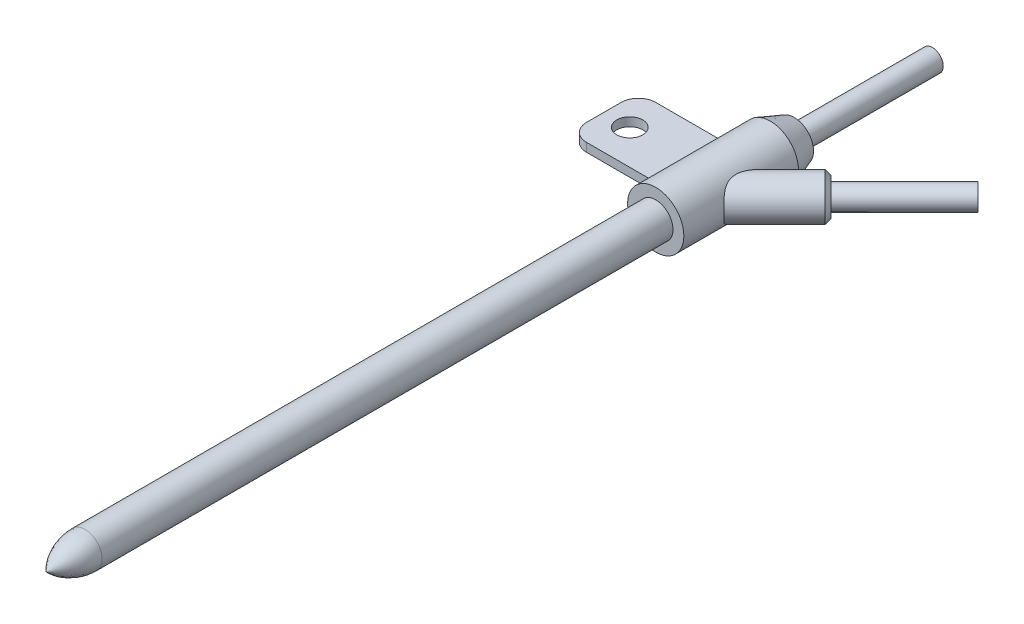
ISO-10303-21;
HEADER;
FILE_DESCRIPTION(('STEP AP214'),'2;1');
FILE_NAME('part.step','',(''),(''),'','','');
FILE_SCHEMA(('AUTOMOTIVE_DESIGN { 1 0 10303 214 1 1 1 1 }'));
ENDSEC;
DATA;
#1=APPLICATION_CONTEXT('core data for automotive mechanical design processes');
#2=APPLICATION_PROTOCOL_DEFINITION('international standard','automotive_design',2000,#1);
#3=PRODUCT_CONTEXT('',#1,'mechanical');
#4=PRODUCT('Part','Part','',(#3));
#5=PRODUCT_RELATED_PRODUCT_CATEGORY('part','',(#4));
#6=PRODUCT_DEFINITION_FORMATION('','',#4);
#7=PRODUCT_DEFINITION_CONTEXT('part definition',#1,'design');
#8=PRODUCT_DEFINITION('design','',#6,#7);
#9=PRODUCT_DEFINITION_SHAPE('','',#8);
#10=(LENGTH_UNIT() NAMED_UNIT(*) SI_UNIT(.MILLI.,.METRE.));
#11=(NAMED_UNIT(*) PLANE_ANGLE_UNIT() SI_UNIT($,.RADIAN.));
#12=(NAMED_UNIT(*) SI_UNIT($,.STERADIAN.) SOLID_ANGLE_UNIT());
#13=UNCERTAINTY_MEASURE_WITH_UNIT(LENGTH_MEASURE(1.E-05),#10,'distance_accuracy_value','');
#14=(GEOMETRIC_REPRESENTATION_CONTEXT(3) GLOBAL_UNCERTAINTY_ASSIGNED_CONTEXT((#13)) GLOBAL_UNIT_ASSIGNED_CONTEXT((#10,
#11,#12)) REPRESENTATION_CONTEXT('',''));
#15=CARTESIAN_POINT('',(0.,0.,0.));
#16=DIRECTION('',(0.,0.,1.));
#17=DIRECTION('',(1.,0.,0.));
#18=AXIS2_PLACEMENT_3D('',#15,#16,#17);
#19=CARTESIAN_POINT('',(0.,0.,-90.));
#20=DIRECTION('',(0.,0.,1.));
#21=DIRECTION('',(1.,0.,0.));
#22=AXIS2_PLACEMENT_3D('',#19,#20,#21);
#23=CYLINDRICAL_SURFACE('',#22,1.25);
#24=CARTESIAN_POINT('',(0.,0.,-82.));
#25=DIRECTION('',(0.,0.,1.));
#26=DIRECTION('',(1.,0.,0.));
#27=AXIS2_PLACEMENT_3D('',#24,#25,#26);
#28=CIRCLE('',#27,1.25);
#29=CARTESIAN_POINT('',(1.25,0.,-82.));
#30=VERTEX_POINT('',#29);
#31=CARTESIAN_POINT('',(-1.25,0.,-82.));
#32=VERTEX_POINT('',#31);
#33=EDGE_CURVE('E222',#30,#32,#28,.T.);
#34=ORIENTED_EDGE('',*,*,#33,.F.);
#35=CARTESIAN_POINT('',(0.,0.,-82.));
#36=DIRECTION('',(0.,0.,1.));
#37=DIRECTION('',(1.,0.,0.));
#38=AXIS2_PLACEMENT_3D('',#35,#36,#37);
#39=CIRCLE('',#38,1.25);
#40=EDGE_CURVE('E238',#32,#30,#39,.T.);
#41=ORIENTED_EDGE('',*,*,#40,.F.);
#42=DIRECTION('',(0.,0.,-1.));
#43=VECTOR('',#42,1.);
#44=CARTESIAN_POINT('',(-1.25,0.,-90.));
#45=LINE('',#44,#43);
#46=CARTESIAN_POINT('',(-1.25,0.,-98.));
#47=VERTEX_POINT('',#46);
#48=EDGE_CURVE('E10',#32,#47,#45,.T.);
#49=ORIENTED_EDGE('',*,*,#48,.T.);
#50=CARTESIAN_POINT('',(0.,0.,-98.));
#51=DIRECTION('',(0.,0.,1.));
#52=DIRECTION('',(1.,0.,0.));
#53=AXIS2_PLACEMENT_3D('',#50,#51,#52);
#54=CIRCLE('',#53,1.25);
#55=CARTESIAN_POINT('',(1.25,0.,-98.));
#56=VERTEX_POINT('',#55);
#57=EDGE_CURVE('E29',#47,#56,#54,.T.);
#58=ORIENTED_EDGE('',*,*,#57,.T.);
#59=CARTESIAN_POINT('',(0.,0.,-98.));
#60=DIRECTION('',(0.,0.,1.));
#61=DIRECTION('',(1.,0.,0.));
#62=AXIS2_PLACEMENT_3D('',#59,#60,#61);
#63=CIRCLE('',#62,1.25);
#64=EDGE_CURVE('E212',#56,#47,#63,.T.);
#65=ORIENTED_EDGE('',*,*,#64,.T.);
#66=ORIENTED_EDGE('',*,*,#48,.F.);
#67=EDGE_LOOP('',(#34,#41,#49,#58,#65,#66));
#68=FACE_BOUND('',#67,.T.);
#69=ADVANCED_FACE('F15',(#68),#23,.T.);
#70=CARTESIAN_POINT('',(1.25,0.,-98.));
#71=DIRECTION('',(0.,0.,-1.));
#72=DIRECTION('',(-1.,0.,0.));
#73=AXIS2_PLACEMENT_3D('',#70,#71,#72);
#74=PLANE('',#73);
#75=ORIENTED_EDGE('',*,*,#64,.F.);
#76=ORIENTED_EDGE('',*,*,#57,.F.);
#77=EDGE_LOOP('',(#75,#76));
#78=FACE_BOUND('',#77,.T.);
#79=ADVANCED_FACE('F335',(#78),#74,.T.);
#80=CARTESIAN_POINT('',(-2.,0.,0.));
#81=CARTESIAN_POINT('',(-2.,-2.,0.));
#82=CARTESIAN_POINT('',(0.,-2.,0.));
#83=CARTESIAN_POINT('',(2.,-2.,0.));
#84=CARTESIAN_POINT('',(2.,0.,0.));
#85=CARTESIAN_POINT('',(2.,2.,0.));
#86=CARTESIAN_POINT('',(0.,2.,0.));
#87=CARTESIAN_POINT('',(-2.,2.,0.));
#88=CARTESIAN_POINT('',(-2.,0.,0.));
#89=CARTESIAN_POINT('',(-2.,0.,2.69444444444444));
#90=CARTESIAN_POINT('',(-2.,-2.,2.69444444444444));
#91=CARTESIAN_POINT('',(0.,-2.,2.69444444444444));
#92=CARTESIAN_POINT('',(2.,-2.,2.69444444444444));
#93=CARTESIAN_POINT('',(2.,0.,2.69444444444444));
#94=CARTESIAN_POINT('',(2.,2.,2.69444444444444));
#95=CARTESIAN_POINT('',(0.,2.,2.69444444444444));
#96=CARTESIAN_POINT('',(-2.,2.,2.69444444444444));
#97=CARTESIAN_POINT('',(-2.,0.,2.69444444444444));
#98=CARTESIAN_POINT('',(0.,0.,4.5));
#99=CARTESIAN_POINT('',(0.,0.,4.5));
#100=CARTESIAN_POINT('',(0.,0.,4.5));
#101=CARTESIAN_POINT('',(0.,0.,4.5));
#102=CARTESIAN_POINT('',(0.,0.,4.5));
#103=CARTESIAN_POINT('',(0.,0.,4.5));
#104=CARTESIAN_POINT('',(0.,0.,4.5));
#105=CARTESIAN_POINT('',(0.,0.,4.5));
#106=CARTESIAN_POINT('',(0.,0.,4.5));
#107=(BOUNDED_SURFACE() B_SPLINE_SURFACE(2,2,((#80,#81,#82,#83,#84,#85,#86,#87,#88),(#89,#90,
#91,#92,#93,#94,#95,#96,#97),(#98,#99,#100,#101,#102,#103,#104,#105,#106)),.UNSPECIFIED.,.F.,
.T.,.F.) B_SPLINE_SURFACE_WITH_KNOTS((3,3),(3,2,2,2,3),(0.,0.836448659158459),
(-3.14159265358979,-1.5707963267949,0.,1.5707963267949,3.14159265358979),
.UNSPECIFIED.) GEOMETRIC_REPRESENTATION_ITEM() RATIONAL_B_SPLINE_SURFACE(((1.,0.707106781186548,
1.,0.707106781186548,1.,0.707106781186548,1.,0.707106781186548,1.),(0.913811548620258,
0.646162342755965,0.913811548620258,0.646162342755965,0.913811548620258,0.646162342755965,
0.913811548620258,0.646162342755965,0.913811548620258),(1.,0.707106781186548,1.,
0.707106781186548,1.,0.707106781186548,1.,0.707106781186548,1.))) REPRESENTATION_ITEM('') SURFACE());
#108=CARTESIAN_POINT('',(4.0625,0.,0.));
#109=DIRECTION('',(0.,-1.,0.));
#110=DIRECTION('',(-1.,0.,0.));
#111=AXIS2_PLACEMENT_3D('',#108,#109,#110);
#112=CIRCLE('',#111,6.0625);
#113=CARTESIAN_POINT('',(0.,0.,4.5));
#114=VERTEX_POINT('',#113);
#115=CARTESIAN_POINT('',(-2.,0.,0.));
#116=VERTEX_POINT('',#115);
#117=EDGE_CURVE('E419',#114,#116,#112,.T.);
#118=CARTESIAN_POINT('',(0.,0.,0.));
#119=DIRECTION('',(0.,0.,1.));
#120=DIRECTION('',(1.,0.,0.));
#121=AXIS2_PLACEMENT_3D('',#118,#119,#120);
#122=CIRCLE('',#121,2.);
#123=CARTESIAN_POINT('',(2.,0.,0.));
#124=VERTEX_POINT('',#123);
#125=EDGE_CURVE('E234',#116,#124,#122,.T.);
#126=CARTESIAN_POINT('',(0.,0.,0.));
#127=DIRECTION('',(0.,0.,1.));
#128=DIRECTION('',(1.,0.,0.));
#129=AXIS2_PLACEMENT_3D('',#126,#127,#128);
#130=CIRCLE('',#129,2.);
#131=EDGE_CURVE('E162',#124,#116,#130,.T.);
#132=ORIENTED_EDGE('',*,*,#117,.T.);
#133=ORIENTED_EDGE('',*,*,#125,.T.);
#134=ORIENTED_EDGE('',*,*,#131,.T.);
#135=ORIENTED_EDGE('',*,*,#117,.F.);
#136=EDGE_LOOP('',(#132,#133,#134,#135));
#137=FACE_BOUND('',#136,.T.);
#138=ADVANCED_FACE('F339',(#137),#107,.F.);
#139=CARTESIAN_POINT('',(0.,0.,-33.));
#140=DIRECTION('',(0.,0.,1.));
#141=DIRECTION('',(1.,0.,0.));
#142=AXIS2_PLACEMENT_3D('',#139,#140,#141);
#143=CYLINDRICAL_SURFACE('',#142,2.);
#144=ORIENTED_EDGE('',*,*,#131,.F.);
#145=ORIENTED_EDGE('',*,*,#125,.F.);
#146=DIRECTION('',(0.,0.,-1.));
#147=VECTOR('',#146,1.);
#148=CARTESIAN_POINT('',(-2.,0.,-33.));
#149=LINE('',#148,#147);
#150=CARTESIAN_POINT('',(-2.,0.,-66.));
#151=VERTEX_POINT('',#150);
#152=EDGE_CURVE('E159',#116,#151,#149,.T.);
#153=ORIENTED_EDGE('',*,*,#152,.T.);
#154=CARTESIAN_POINT('',(0.,0.,-66.));
#155=DIRECTION('',(0.,0.,1.));
#156=DIRECTION('',(1.,0.,0.));
#157=AXIS2_PLACEMENT_3D('',#154,#155,#156);
#158=CIRCLE('',#157,2.);
#159=CARTESIAN_POINT('',(2.,0.,-66.));
#160=VERTEX_POINT('',#159);
#161=EDGE_CURVE('E152',#151,#160,#158,.T.);
#162=ORIENTED_EDGE('',*,*,#161,.T.);
#163=CARTESIAN_POINT('',(0.,0.,-66.));
#164=DIRECTION('',(0.,0.,1.));
#165=DIRECTION('',(1.,0.,0.));
#166=AXIS2_PLACEMENT_3D('',#163,#164,#165);
#167=CIRCLE('',#166,2.);
#168=EDGE_CURVE('E157',#160,#151,#167,.T.);
#169=ORIENTED_EDGE('',*,*,#168,.T.);
#170=ORIENTED_EDGE('',*,*,#152,.F.);
#171=EDGE_LOOP('',(#144,#145,#153,#162,#169,#170));
#172=FACE_BOUND('',#171,.T.);
#173=ADVANCED_FACE('F155',(#172),#143,.T.);
#174=CARTESIAN_POINT('',(2.,0.,-66.));
#175=DIRECTION('',(0.,0.,1.));
#176=DIRECTION('',(1.,0.,0.));
#177=AXIS2_PLACEMENT_3D('',#174,#175,#176);
#178=PLANE('',#177);
#179=ORIENTED_EDGE('',*,*,#168,.F.);
#180=ORIENTED_EDGE('',*,*,#161,.F.);
#181=EDGE_LOOP('',(#179,#180));
#182=FACE_BOUND('',#181,.T.);
#183=CARTESIAN_POINT('',(0.,0.,-66.));
#184=DIRECTION('',(0.,0.,1.));
#185=DIRECTION('',(1.,0.,0.));
#186=AXIS2_PLACEMENT_3D('',#183,#184,#185);
#187=CIRCLE('',#186,3.25);
#188=CARTESIAN_POINT('',(3.25,0.,-66.));
#189=VERTEX_POINT('',#188);
#190=CARTESIAN_POINT('',(-3.25,0.,-66.));
#191=VERTEX_POINT('',#190);
#192=EDGE_CURVE('E296',#189,#191,#187,.T.);
#193=ORIENTED_EDGE('',*,*,#192,.T.);
#194=CARTESIAN_POINT('',(0.,0.,-66.));
#195=DIRECTION('',(0.,0.,1.));
#196=DIRECTION('',(1.,0.,0.));
#197=AXIS2_PLACEMENT_3D('',#194,#195,#196);
#198=CIRCLE('',#197,3.25);
#199=EDGE_CURVE('E292',#191,#189,#198,.T.);
#200=ORIENTED_EDGE('',*,*,#199,.T.);
#201=EDGE_LOOP('',(#193,#200));
#202=FACE_BOUND('',#201,.T.);
#203=ADVANCED_FACE('F164',(#182,#202),#178,.T.);
#204=CARTESIAN_POINT('',(0.,0.,-74.));
#205=DIRECTION('',(0.,0.,1.));
#206=DIRECTION('',(1.,0.,0.));
#207=AXIS2_PLACEMENT_3D('',#204,#205,#206);
#208=CYLINDRICAL_SURFACE('',#207,3.25);
#209=CARTESIAN_POINT('',(2.34520787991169,2.25000000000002,-72.8977445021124));
#210=CARTESIAN_POINT('',(2.34521570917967,2.24998859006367,-72.9500101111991));
#211=CARTESIAN_POINT('',(2.34604445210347,2.24912802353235,-73.0022682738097));
#212=CARTESIAN_POINT('',(2.3492613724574,2.24576946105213,-73.1079119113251));
#213=CARTESIAN_POINT('',(2.35168563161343,2.24323357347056,-73.1612951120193));
#214=CARTESIAN_POINT('',(2.35807803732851,2.23651263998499,-73.2691870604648));
#215=CARTESIAN_POINT('',(2.36208274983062,2.23228850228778,-73.3236911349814));
#216=CARTESIAN_POINT('',(2.37160847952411,2.22216627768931,-73.4338282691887));
#217=CARTESIAN_POINT('',(2.37716572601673,2.216228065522,-73.4894544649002));
#218=CARTESIAN_POINT('',(2.38975906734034,2.20264374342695,-73.6018377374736));
#219=CARTESIAN_POINT('',(2.3968303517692,2.19495665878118,-73.6585858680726));
#220=CARTESIAN_POINT('',(2.4124033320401,2.17783094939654,-73.7732151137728));
#221=CARTESIAN_POINT('',(2.42093852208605,2.16835060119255,-73.8310853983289));
#222=CARTESIAN_POINT('',(2.43937949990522,2.1475860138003,-73.9479608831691));
#223=CARTESIAN_POINT('',(2.44931650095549,2.13625937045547,-74.0069535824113));
#224=CARTESIAN_POINT('',(2.47048945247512,2.11174128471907,-74.1260751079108));
#225=CARTESIAN_POINT('',(2.48175381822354,2.09850678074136,-74.1861899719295));
#226=CARTESIAN_POINT('',(2.50549650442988,2.07010623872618,-74.3075588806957));
#227=CARTESIAN_POINT('',(2.5179999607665,2.05489654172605,-74.3687977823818));
#228=CARTESIAN_POINT('',(2.5441249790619,2.0224667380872,-74.4924095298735));
#229=CARTESIAN_POINT('',(2.55776805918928,2.00520222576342,-74.5547660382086));
#230=CARTESIAN_POINT('',(2.59837263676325,1.95265801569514,-74.7354685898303));
#231=CARTESIAN_POINT('',(2.62613980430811,1.91530017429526,-74.8530465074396));
#232=CARTESIAN_POINT('',(2.66875101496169,1.8549515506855,-75.0255469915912));
#233=CARTESIAN_POINT('',(2.68288165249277,1.83447652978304,-75.0815365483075));
#234=CARTESIAN_POINT('',(2.71124340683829,1.79228718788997,-75.1916655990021));
#235=CARTESIAN_POINT('',(2.72546682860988,1.77060594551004,-75.2458196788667));
#236=CARTESIAN_POINT('',(2.75394073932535,1.7259770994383,-75.3522751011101));
#237=CARTESIAN_POINT('',(2.76818522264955,1.70306268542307,-75.404591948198));
#238=CARTESIAN_POINT('',(2.79662411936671,1.65593973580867,-75.5073725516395));
#239=CARTESIAN_POINT('',(2.81081429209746,1.63176427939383,-75.5578526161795));
#240=CARTESIAN_POINT('',(2.8390629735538,1.58209433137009,-75.6569585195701));
#241=CARTESIAN_POINT('',(2.85311906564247,1.55663249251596,-75.7056013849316));
#242=CARTESIAN_POINT('',(2.88101315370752,1.50436864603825,-75.8010330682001));
#243=CARTESIAN_POINT('',(2.89485058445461,1.4775985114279,-75.847839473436));
#244=CARTESIAN_POINT('',(2.92221824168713,1.42269639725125,-75.9395946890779));
#245=CARTESIAN_POINT('',(2.93574969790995,1.39459521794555,-75.9845615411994));
#246=CARTESIAN_POINT('',(2.96240573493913,1.3370275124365,-76.072648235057));
#247=CARTESIAN_POINT('',(2.97553336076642,1.30759010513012,-76.1157861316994));
#248=CARTESIAN_POINT('',(2.99756216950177,1.25604592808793,-76.1879314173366));
#249=CARTESIAN_POINT('',(3.00653876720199,1.23442049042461,-76.2172600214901));
#250=CARTESIAN_POINT('',(3.0240405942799,1.19088633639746,-76.2742414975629));
#251=CARTESIAN_POINT('',(3.03257095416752,1.16901038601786,-76.3019177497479));
#252=CARTESIAN_POINT('',(3.04916831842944,1.12499223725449,-76.3555992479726));
#253=CARTESIAN_POINT('',(3.05724131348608,1.1028828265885,-76.3816294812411));
#254=CARTESIAN_POINT('',(3.07291675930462,1.05840443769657,-76.4320154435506));
#255=CARTESIAN_POINT('',(3.08052593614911,1.03606838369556,-76.4563980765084));
#256=CARTESIAN_POINT('',(3.09526550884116,0.99114661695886,-76.5034873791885));
#257=CARTESIAN_POINT('',(3.1024034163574,0.968593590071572,-76.5262228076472));
#258=CARTESIAN_POINT('',(3.11619268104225,0.923247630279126,-76.5700157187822));
#259=CARTESIAN_POINT('',(3.1228523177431,0.900486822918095,-76.5911037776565));
#260=CARTESIAN_POINT('',(3.13567739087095,0.854735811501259,-76.6316001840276));
#261=CARTESIAN_POINT('',(3.14185184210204,0.831776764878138,-76.6510407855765));
#262=CARTESIAN_POINT('',(3.15369913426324,0.785640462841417,-76.6882406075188));
#263=CARTESIAN_POINT('',(3.15938165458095,0.762492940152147,-76.7060335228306));
#264=CARTESIAN_POINT('',(3.17023798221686,0.715991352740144,-76.7399366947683));
#265=CARTESIAN_POINT('',(3.17542201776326,0.692665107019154,-76.7560817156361));
#266=CARTESIAN_POINT('',(3.18527447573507,0.645819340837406,-76.7866878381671));
#267=CARTESIAN_POINT('',(3.18995351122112,0.622325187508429,-76.8011842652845));
#268=CARTESIAN_POINT('',(3.19878992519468,0.575154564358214,-76.8284939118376));
#269=CARTESIAN_POINT('',(3.20295806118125,0.551500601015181,-76.8413422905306));
#270=CARTESIAN_POINT('',(3.20885028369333,0.515676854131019,-76.8594626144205));
#271=CARTESIAN_POINT('',(3.21073750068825,0.503796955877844,-76.8652591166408));
#272=CARTESIAN_POINT('',(3.21438070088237,0.479999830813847,-76.8764359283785));
#273=CARTESIAN_POINT('',(3.21613798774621,0.468084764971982,-76.8818203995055));
#274=CARTESIAN_POINT('',(3.2195205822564,0.444219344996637,-76.8921730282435));
#275=CARTESIAN_POINT('',(3.22114715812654,0.432270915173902,-76.897145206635));
#276=CARTESIAN_POINT('',(3.22426770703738,0.408340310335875,-76.9066734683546));
#277=CARTESIAN_POINT('',(3.22576289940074,0.396359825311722,-76.9112333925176));
#278=CARTESIAN_POINT('',(3.2286200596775,0.37236680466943,-76.9199373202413));
#279=CARTESIAN_POINT('',(3.22998318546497,0.36035572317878,-76.9240849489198));
#280=CARTESIAN_POINT('',(3.23257562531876,0.336303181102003,-76.9319645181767));
#281=CARTESIAN_POINT('',(3.23380602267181,0.32426294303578,-76.9356998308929));
#282=CARTESIAN_POINT('',(3.23613244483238,0.300153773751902,-76.9427550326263));
#283=CARTESIAN_POINT('',(3.2372294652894,0.288085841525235,-76.9460780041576));
#284=CARTESIAN_POINT('',(3.23928860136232,0.263922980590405,-76.9523088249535));
#285=CARTESIAN_POINT('',(3.24025161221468,0.251828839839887,-76.9552194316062));
#286=CARTESIAN_POINT('',(3.24204222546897,0.22761522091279,-76.960625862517));
#287=CARTESIAN_POINT('',(3.24287061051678,0.215496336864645,-76.9631240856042));
#288=CARTESIAN_POINT('',(3.2443914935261,0.191235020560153,-76.9677061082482));
#289=CARTESIAN_POINT('',(3.24508465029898,0.179093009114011,-76.9697919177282));
#290=CARTESIAN_POINT('',(3.24642218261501,0.153084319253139,-76.9738127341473));
#291=CARTESIAN_POINT('',(3.24704713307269,0.139207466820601,-76.9756887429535));
#292=CARTESIAN_POINT('',(3.24811891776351,0.111427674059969,-76.9789023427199));
#293=CARTESIAN_POINT('',(3.24856628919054,0.0975249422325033,-76.9802415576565));
#294=CARTESIAN_POINT('',(3.24928237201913,0.0696957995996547,-76.9823826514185));
#295=CARTESIAN_POINT('',(3.2495513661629,0.0557694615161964,-76.9831853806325));
#296=CARTESIAN_POINT('',(3.24991016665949,0.0278952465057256,-76.9842531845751));
#297=CARTESIAN_POINT('',(3.24999999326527,0.0139473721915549,-76.9845183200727));
#298=CARTESIAN_POINT('',(3.25000000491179,-0.010172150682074,-76.9845161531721));
#299=CARTESIAN_POINT('',(3.24995223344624,-0.0203440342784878,-76.9843735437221));
#300=CARTESIAN_POINT('',(3.24976135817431,-0.0406742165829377,-76.9838074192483));
#301=CARTESIAN_POINT('',(3.24961830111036,-0.0508325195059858,-76.9833840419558));
#302=CARTESIAN_POINT('',(3.24923729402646,-0.0711344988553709,-76.9822557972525));
#303=CARTESIAN_POINT('',(3.24899931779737,-0.0812781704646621,-76.981550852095));
#304=CARTESIAN_POINT('',(3.24842893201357,-0.101549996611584,-76.9798599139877));
#305=CARTESIAN_POINT('',(3.24809642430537,-0.111678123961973,-76.978873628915));
#306=CARTESIAN_POINT('',(3.24727518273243,-0.133577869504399,-76.9764353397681));
#307=CARTESIAN_POINT('',(3.2467696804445,-0.145343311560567,-76.9749332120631));
#308=CARTESIAN_POINT('',(3.24563219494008,-0.168850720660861,-76.9715490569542));
#309=CARTESIAN_POINT('',(3.24499982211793,-0.180592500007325,-76.9696658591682));
#310=CARTESIAN_POINT('',(3.24360935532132,-0.204051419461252,-76.965519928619));
#311=CARTESIAN_POINT('',(3.24285075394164,-0.215768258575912,-76.9632556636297));
#312=CARTESIAN_POINT('',(3.24120859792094,-0.239176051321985,-76.9583479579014));
#313=CARTESIAN_POINT('',(3.24032442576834,-0.250866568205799,-76.9557026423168));
#314=CARTESIAN_POINT('',(3.23843190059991,-0.274220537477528,-76.9500331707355));
#315=CARTESIAN_POINT('',(3.2374228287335,-0.285883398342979,-76.9470068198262));
#316=CARTESIAN_POINT('',(3.23528128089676,-0.309180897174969,-76.9405755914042));
#317=CARTESIAN_POINT('',(3.23414799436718,-0.320814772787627,-76.9371682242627));
#318=CARTESIAN_POINT('',(3.23175879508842,-0.344053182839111,-76.9299752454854));
#319=CARTESIAN_POINT('',(3.23050199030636,-0.355656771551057,-76.9261868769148));
#320=CARTESIAN_POINT('',(3.2278665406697,-0.378833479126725,-76.9182321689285));
#321=CARTESIAN_POINT('',(3.2264869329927,-0.390405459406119,-76.914062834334));
#322=CARTESIAN_POINT('',(3.22360664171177,-0.413517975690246,-76.9053463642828));
#323=CARTESIAN_POINT('',(3.22210493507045,-0.425057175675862,-76.9007960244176));
#324=CARTESIAN_POINT('',(3.21898130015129,-0.448102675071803,-76.8913179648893));
#325=CARTESIAN_POINT('',(3.21735830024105,-0.459607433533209,-76.8863868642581));
#326=CARTESIAN_POINT('',(3.21228139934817,-0.494266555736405,-76.8709402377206));
#327=CARTESIAN_POINT('',(3.20866853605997,-0.517174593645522,-76.8599193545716));
#328=CARTESIAN_POINT('',(3.20097585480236,-0.562852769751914,-76.8363840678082));
#329=CARTESIAN_POINT('',(3.19688677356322,-0.58560581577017,-76.8238397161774));
#330=CARTESIAN_POINT('',(3.18824787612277,-0.630969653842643,-76.7972580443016));
#331=CARTESIAN_POINT('',(3.18368869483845,-0.653560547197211,-76.783189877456));
#332=CARTESIAN_POINT('',(3.17411607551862,-0.698592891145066,-76.7535614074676));
#333=CARTESIAN_POINT('',(3.16909341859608,-0.721011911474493,-76.7379700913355));
#334=CARTESIAN_POINT('',(3.15860016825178,-0.765693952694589,-76.705295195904));
#335=CARTESIAN_POINT('',(3.15312068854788,-0.787932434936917,-76.6881810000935));
#336=CARTESIAN_POINT('',(3.14172012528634,-0.832246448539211,-76.6524597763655));
#337=CARTESIAN_POINT('',(3.13579063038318,-0.854295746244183,-76.633822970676));
#338=CARTESIAN_POINT('',(3.12349638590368,-0.898224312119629,-76.5950555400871));
#339=CARTESIAN_POINT('',(3.11712379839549,-0.920076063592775,-76.5748962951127));
#340=CARTESIAN_POINT('',(3.10394977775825,-0.963602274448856,-76.5330827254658));
#341=CARTESIAN_POINT('',(3.09714114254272,-0.985248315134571,-76.5114011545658));
#342=CARTESIAN_POINT('',(3.08310152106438,-1.02835570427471,-76.4665414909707));
#343=CARTESIAN_POINT('',(3.07586400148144,-1.04978807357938,-76.4433376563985));
#344=CARTESIAN_POINT('',(3.06097320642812,-1.09246065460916,-76.3954319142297));
#345=CARTESIAN_POINT('',(3.0533140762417,-1.11367162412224,-76.3707058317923));
#346=CARTESIAN_POINT('',(3.03758679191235,-1.15589378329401,-76.3197540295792));
#347=CARTESIAN_POINT('',(3.02951345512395,-1.17687571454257,-76.293505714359));
#348=CARTESIAN_POINT('',(3.01296454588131,-1.21863261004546,-76.2395077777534));
#349=CARTESIAN_POINT('',(3.00448444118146,-1.23937852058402,-76.2117371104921));
#350=CARTESIAN_POINT('',(2.98712919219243,-1.28065452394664,-76.1546932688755));
#351=CARTESIAN_POINT('',(2.97825014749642,-1.30115587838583,-76.1254005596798));
#352=CARTESIAN_POINT('',(2.95059616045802,-1.36330771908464,-76.0338284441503));
#353=CARTESIAN_POINT('',(2.93164735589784,-1.40349520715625,-75.9706033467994));
#354=CARTESIAN_POINT('',(2.89884650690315,-1.46974174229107,-75.8602989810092));
#355=CARTESIAN_POINT('',(2.88505797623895,-1.49659841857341,-75.8136732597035));
#356=CARTESIAN_POINT('',(2.85732658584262,-1.54889327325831,-75.7190513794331));
#357=CARTESIAN_POINT('',(2.84338351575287,-1.57431535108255,-75.6710463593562));
#358=CARTESIAN_POINT('',(2.81543628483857,-1.62377134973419,-75.5736712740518));
#359=CARTESIAN_POINT('',(2.80143301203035,-1.647787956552,-75.5242921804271));
#360=CARTESIAN_POINT('',(2.77345264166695,-1.69446428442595,-75.4241678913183));
#361=CARTESIAN_POINT('',(2.75947761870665,-1.71710565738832,-75.3734135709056));
#362=CARTESIAN_POINT('',(2.73163611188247,-1.76106485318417,-75.2705386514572));
#363=CARTESIAN_POINT('',(2.7177729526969,-1.7823634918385,-75.2184089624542));
#364=CARTESIAN_POINT('',(2.69023067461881,-1.82367267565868,-75.1127854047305));
#365=CARTESIAN_POINT('',(2.67655613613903,-1.84366340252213,-75.0592826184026));
#366=CARTESIAN_POINT('',(2.63564616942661,-1.90214901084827,-74.8956069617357));
#367=CARTESIAN_POINT('',(2.60910672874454,-1.93825239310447,-74.7843985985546));
#368=CARTESIAN_POINT('',(2.55751197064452,-2.00586379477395,-74.5565750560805));
#369=CARTESIAN_POINT('',(2.53252226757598,-2.03720762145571,-74.4398966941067));
#370=CARTESIAN_POINT('',(2.49698624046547,-2.08036282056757,-74.2626216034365));
#371=CARTESIAN_POINT('',(2.48539013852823,-2.09418885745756,-74.2027183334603));
#372=CARTESIAN_POINT('',(2.46347134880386,-2.11992671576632,-74.0839415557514));
#373=CARTESIAN_POINT('',(2.45312346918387,-2.13187882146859,-74.0250815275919));
#374=CARTESIAN_POINT('',(2.43375402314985,-2.15396165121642,-73.908407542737));
#375=CARTESIAN_POINT('',(2.42470525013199,-2.16413122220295,-73.8506054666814));
#376=CARTESIAN_POINT('',(2.40800747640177,-2.18269380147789,-73.7360442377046));
#377=CARTESIAN_POINT('',(2.40032886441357,-2.19112523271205,-73.6792956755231));
#378=CARTESIAN_POINT('',(2.38641978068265,-2.20626461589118,-73.5668457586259));
#379=CARTESIAN_POINT('',(2.38015811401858,-2.21301012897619,-73.5111533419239));
#380=CARTESIAN_POINT('',(2.36879226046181,-2.22517310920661,-73.3973104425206));
#381=CARTESIAN_POINT('',(2.36374191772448,-2.23052944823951,-73.339147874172));
#382=CARTESIAN_POINT('',(2.35647448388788,-2.23820190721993,-73.2383068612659));
#383=CARTESIAN_POINT('',(2.35386057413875,-2.24094842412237,-73.1956893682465));
#384=CARTESIAN_POINT('',(2.34965428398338,-2.24535829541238,-73.1113090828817));
#385=CARTESIAN_POINT('',(2.34804026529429,-2.24704460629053,-73.0695486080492));
#386=CARTESIAN_POINT('',(2.34598539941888,-2.24918971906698,-72.9913404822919));
#387=CARTESIAN_POINT('',(2.34542044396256,-2.24977841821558,-72.9548997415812));
#388=CARTESIAN_POINT('',(2.3451579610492,-2.25005204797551,-72.882788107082));
#389=CARTESIAN_POINT('',(2.34544218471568,-2.24975599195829,-72.8471173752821));
#390=CARTESIAN_POINT('',(2.34686976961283,-2.24826674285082,-72.7765470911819));
#391=CARTESIAN_POINT('',(2.34799529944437,-2.24709216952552,-72.7416467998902));
#392=CARTESIAN_POINT('',(2.3511058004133,-2.24383745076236,-72.6726183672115));
#393=CARTESIAN_POINT('',(2.35307334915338,-2.2417756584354,-72.6384885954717));
#394=CARTESIAN_POINT('',(2.35767909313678,-2.2369307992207,-72.5734014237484));
#395=CARTESIAN_POINT('',(2.36024178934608,-2.23422849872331,-72.5424326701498));
#396=CARTESIAN_POINT('',(2.36607036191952,-2.22805493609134,-72.481180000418));
#397=CARTESIAN_POINT('',(2.36932339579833,-2.2245976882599,-72.4508934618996));
#398=CARTESIAN_POINT('',(2.37652468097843,-2.2169027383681,-72.3910063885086));
#399=CARTESIAN_POINT('',(2.38046085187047,-2.21267854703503,-72.3614026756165));
#400=CARTESIAN_POINT('',(2.38901473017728,-2.20343996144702,-72.3028816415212));
#401=CARTESIAN_POINT('',(2.39362132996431,-2.19843836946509,-72.2739606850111));
#402=CARTESIAN_POINT('',(2.40350082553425,-2.18763265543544,-72.2168056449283));
#403=CARTESIAN_POINT('',(2.40876371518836,-2.18184048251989,-72.1885675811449));
#404=CARTESIAN_POINT('',(2.41993784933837,-2.16943992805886,-72.1327786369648));
#405=CARTESIAN_POINT('',(2.42584031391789,-2.16284247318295,-72.1052235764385));
#406=CARTESIAN_POINT('',(2.43827319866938,-2.14881611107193,-72.0508008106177));
#407=CARTESIAN_POINT('',(2.44479615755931,-2.14139694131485,-72.0239288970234));
#408=CARTESIAN_POINT('',(2.45844705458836,-2.12571051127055,-71.9708724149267));
#409=CARTESIAN_POINT('',(2.46556890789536,-2.1174516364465,-71.9446838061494));
#410=CARTESIAN_POINT('',(2.48039201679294,-2.10006784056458,-71.8929937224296));
#411=CARTESIAN_POINT('',(2.4880885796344,-2.09094980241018,-71.8674885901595));
#412=CARTESIAN_POINT('',(2.50403288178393,-2.0718285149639,-71.8171650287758));
#413=CARTESIAN_POINT('',(2.51227728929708,-2.06183051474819,-71.7923435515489));
#414=CARTESIAN_POINT('',(2.52928636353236,-2.04092903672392,-71.7433866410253));
#415=CARTESIAN_POINT('',(2.53804897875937,-2.03002906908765,-71.7192489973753));
#416=CARTESIAN_POINT('',(2.55606081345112,-2.00730240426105,-71.6716588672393));
#417=CARTESIAN_POINT('',(2.56530913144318,-1.99547740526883,-71.6482052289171));
#418=CARTESIAN_POINT('',(2.58425592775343,-1.97087856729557,-71.6019820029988));
#419=CARTESIAN_POINT('',(2.59395447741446,-1.95810457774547,-71.5792125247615));
#420=CARTESIAN_POINT('',(2.61376245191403,-1.93158491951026,-71.5343563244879));
#421=CARTESIAN_POINT('',(2.62387270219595,-1.91783725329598,-71.5122711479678));
#422=CARTESIAN_POINT('',(2.64446187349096,-1.88934685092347,-71.4687820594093));
#423=CARTESIAN_POINT('',(2.65494212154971,-1.87460031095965,-71.4473812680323));
#424=CARTESIAN_POINT('',(2.67622614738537,-1.84408828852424,-71.4052594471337));
#425=CARTESIAN_POINT('',(2.68703147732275,-1.82831727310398,-71.3845432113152));
#426=CARTESIAN_POINT('',(2.70891730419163,-1.79573250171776,-71.3437884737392));
#427=CARTESIAN_POINT('',(2.719999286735,-1.77891159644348,-71.3237564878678));
#428=CARTESIAN_POINT('',(2.74238752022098,-1.74420214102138,-71.284369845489));
#429=CARTESIAN_POINT('',(2.75369490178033,-1.72630495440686,-71.2650234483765));
#430=CARTESIAN_POINT('',(2.77647748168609,-1.68942241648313,-71.2270012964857));
#431=CARTESIAN_POINT('',(2.78795314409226,-1.67042714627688,-71.2083354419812));
#432=CARTESIAN_POINT('',(2.81102127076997,-1.63131263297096,-71.171691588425));
#433=CARTESIAN_POINT('',(2.82261336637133,-1.61118217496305,-71.1537253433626));
#434=CARTESIAN_POINT('',(2.84541989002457,-1.57054679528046,-71.119026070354));
#435=CARTESIAN_POINT('',(2.85663711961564,-1.55005880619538,-71.1022749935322));
#436=CARTESIAN_POINT('',(2.87882877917,-1.50844261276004,-71.0696206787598));
#437=CARTESIAN_POINT('',(2.88980398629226,-1.48731722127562,-71.0537143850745));
#438=CARTESIAN_POINT('',(2.91148618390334,-1.44441134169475,-71.0227680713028));
#439=CARTESIAN_POINT('',(2.92219383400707,-1.42263283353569,-71.0077257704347));
#440=CARTESIAN_POINT('',(2.94330623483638,-1.37842213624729,-70.978501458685));
#441=CARTESIAN_POINT('',(2.95371144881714,-1.35599106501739,-70.9643180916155));
#442=CARTESIAN_POINT('',(2.97418578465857,-1.31047370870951,-70.9368120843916));
#443=CARTESIAN_POINT('',(2.98425505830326,-1.28738772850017,-70.9234890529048));
#444=CARTESIAN_POINT('',(3.00402297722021,-1.24056127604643,-70.8977023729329));
#445=CARTESIAN_POINT('',(3.0137213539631,-1.21682035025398,-70.8852393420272));
#446=CARTESIAN_POINT('',(3.03271238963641,-1.16868567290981,-70.8611717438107));
#447=CARTESIAN_POINT('',(3.04200425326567,-1.14429078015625,-70.8495688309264));
#448=CARTESIAN_POINT('',(3.06014644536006,-1.09485121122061,-70.8272204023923));
#449=CARTESIAN_POINT('',(3.0689953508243,-1.06980479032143,-70.8164775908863));
#450=CARTESIAN_POINT('',(3.08621516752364,-1.0190665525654,-70.795848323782));
#451=CARTESIAN_POINT('',(3.0945839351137,-0.993372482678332,-70.7859656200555));
#452=CARTESIAN_POINT('',(3.11080639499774,-0.941344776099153,-70.7670555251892));
#453=CARTESIAN_POINT('',(3.11865713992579,-0.915008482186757,-70.7580329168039));
#454=CARTESIAN_POINT('',(3.13380589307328,-0.861703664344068,-70.7408419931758));
#455=CARTESIAN_POINT('',(3.1411000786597,-0.834732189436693,-70.7326794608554));
#456=CARTESIAN_POINT('',(3.15509751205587,-0.78016593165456,-70.7172077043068));
#457=CARTESIAN_POINT('',(3.16179600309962,-0.752568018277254,-70.70990521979));
#458=CARTESIAN_POINT('',(3.17456335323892,-0.696759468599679,-70.6961526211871));
#459=CARTESIAN_POINT('',(3.18062647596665,-0.668545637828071,-70.6897101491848));
#460=CARTESIAN_POINT('',(3.19208395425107,-0.611517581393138,-70.6776766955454));
#461=CARTESIAN_POINT('',(3.19747156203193,-0.58270021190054,-70.6720941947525));
#462=CARTESIAN_POINT('',(3.20753849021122,-0.524479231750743,-70.6617798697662));
#463=CARTESIAN_POINT('',(3.21221003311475,-0.495072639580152,-70.6570572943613));
#464=CARTESIAN_POINT('',(3.22080499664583,-0.435689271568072,-70.6484620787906));
#465=CARTESIAN_POINT('',(3.22471960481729,-0.405709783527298,-70.6445993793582));
#466=CARTESIAN_POINT('',(3.23176059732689,-0.345198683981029,-70.6377232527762));
#467=CARTESIAN_POINT('',(3.23487714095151,-0.314664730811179,-70.6347203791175));
#468=CARTESIAN_POINT('',(3.24028180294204,-0.253064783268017,-70.629563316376));
#469=CARTESIAN_POINT('',(3.24255907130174,-0.221996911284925,-70.6274202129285));
#470=CARTESIAN_POINT('',(3.24624463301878,-0.159351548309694,-70.6239822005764));
#471=CARTESIAN_POINT('',(3.24764109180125,-0.127772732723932,-70.6226988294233));
#472=CARTESIAN_POINT('',(3.24952550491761,-0.0641294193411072,-70.6209798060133));
#473=CARTESIAN_POINT('',(3.25000069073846,-0.0320642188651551,-70.6205560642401));
#474=CARTESIAN_POINT('',(3.25,0.,-70.6205561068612));
#475=B_SPLINE_CURVE_WITH_KNOTS('',3,(#209,#210,#211,#212,#213,#214,#215,#216,#217,#218,#219,
#220,#221,#222,#223,#224,#225,#226,#227,#228,#229,#230,#231,#232,#233,#234,#235,#236,#237,#238,
#239,#240,#241,#242,#243,#244,#245,#246,#247,#248,#249,#250,#251,#252,#253,#254,#255,#256,#257,
#258,#259,#260,#261,#262,#263,#264,#265,#266,#267,#268,#269,#270,#271,#272,#273,#274,#275,#276,
#277,#278,#279,#280,#281,#282,#283,#284,#285,#286,#287,#288,#289,#290,#291,#292,#293,#294,#295,
#296,#297,#298,#299,#300,#301,#302,#303,#304,#305,#306,#307,#308,#309,#310,#311,#312,#313,#314,
#315,#316,#317,#318,#319,#320,#321,#322,#323,#324,#325,#326,#327,#328,#329,#330,#331,#332,#333,
#334,#335,#336,#337,#338,#339,#340,#341,#342,#343,#344,#345,#346,#347,#348,#349,#350,#351,#352,
#353,#354,#355,#356,#357,#358,#359,#360,#361,#362,#363,#364,#365,#366,#367,#368,#369,#370,#371,
#372,#373,#374,#375,#376,#377,#378,#379,#380,#381,#382,#383,#384,#385,#386,#387,#388,#389,#390,
#391,#392,#393,#394,#395,#396,#397,#398,#399,#400,#401,#402,#403,#404,#405,#406,#407,#408,#409,
#410,#411,#412,#413,#414,#415,#416,#417,#418,#419,#420,#421,#422,#423,#424,#425,#426,#427,#428,
#429,#430,#431,#432,#433,#434,#435,#436,#437,#438,#439,#440,#441,#442,#443,#444,#445,#446,#447,
#448,#449,#450,#451,#452,#453,#454,#455,#456,#457,#458,#459,#460,#461,#462,#463,#464,#465,#466,
#467,#468,#469,#470,#471,#472,#473,#474),.UNSPECIFIED.,.F.,.F.,(4,2,2,2,2,2,2,2,2,2,2,2,2,2,2,2,
2,2,2,2,2,2,2,2,2,2,2,2,2,2,2,2,2,2,2,2,2,2,2,2,2,2,2,2,2,2,2,2,2,2,2,2,2,2,2,2,2,2,2,2,2,2,2,2,
2,2,2,2,2,2,2,2,2,2,2,2,2,2,2,2,2,2,2,2,2,2,2,2,2,2,2,2,2,2,2,2,2,2,2,2,2,2,2,2,2,2,2,2,2,2,2,2,
2,2,2,2,2,2,2,2,2,2,2,2,2,2,2,2,2,2,2,2,4),(0.,0.156773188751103,0.317219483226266,
0.481618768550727,0.650231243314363,0.823298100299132,1.00104239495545,1.18367003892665,
1.37137086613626,1.56431972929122,1.76267759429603,2.1418207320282,2.32560199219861,
2.50569847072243,2.68226166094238,2.85545232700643,3.02544080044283,3.1924072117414,
3.35654163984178,3.51804416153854,3.63061301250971,3.73947580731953,3.84473477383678,
3.94650300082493,4.04490561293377,4.14008100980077,4.2321821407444,4.32137777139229,
4.40785368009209,4.49181370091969,4.57348050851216,4.61353331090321,4.65310519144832,
4.69222937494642,4.73094023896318,4.76927327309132,4.80726502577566,4.84495303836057,
4.88237576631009,4.91957248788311,4.95658320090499,4.99862272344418,5.04053408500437,
5.08237885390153,5.12421889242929,5.15473382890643,5.18523380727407,5.21574221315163,
5.24628241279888,5.28189059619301,5.31760984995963,5.35347631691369,5.38952569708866,
5.42579315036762,5.46231320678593,5.49911968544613,5.53624562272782,5.57372321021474,
5.61158374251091,5.68856596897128,5.76743200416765,5.84839678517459,5.93165899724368,
6.01740135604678,6.10579119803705,6.19698128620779,6.29111075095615,6.38830610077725,
6.48868225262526,6.59234354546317,6.69938471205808,6.80989179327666,7.04158841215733,
7.20819970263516,7.37641114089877,7.5463831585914,7.71827125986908,7.89222581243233,
8.06839189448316,8.42787637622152,8.79781621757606,8.98548152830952,9.16828932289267,
9.34640929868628,9.52002490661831,9.68933424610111,9.86516197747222,9.9934984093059,
10.1189505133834,10.2282808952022,10.3352787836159,10.4400709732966,10.5427924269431,
10.6363488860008,10.7282973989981,10.8187604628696,10.9078667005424,10.9957506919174,
11.082552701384,11.1684182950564,11.2534978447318,11.3379459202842,11.4219205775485,
11.5055825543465,11.5890943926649,11.6726195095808,11.7563212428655,11.8403618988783,
11.9249018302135,12.0100985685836,12.0961060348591,12.1830738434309,12.2711467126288,
12.3573562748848,12.4432291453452,12.5288637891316,12.6143594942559,12.6998160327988,
12.7853333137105,12.8710110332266,12.9569483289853,13.0432434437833,13.1299934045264,
13.2172937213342,13.3052381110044,13.3939182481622,13.4834235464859,13.5738409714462,
13.6652548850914,13.7577469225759,13.8513958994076,13.9462777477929,14.0424654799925),.UNSPECIFIED.);
#476=CARTESIAN_POINT('',(2.34520787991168,2.25,-72.8977445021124));
#477=VERTEX_POINT('',#476);
#478=CARTESIAN_POINT('',(3.25,0.,-70.6205561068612));
#479=VERTEX_POINT('',#478);
#480=EDGE_CURVE('E879',#477,#479,#475,.T.);
#481=ORIENTED_EDGE('',*,*,#480,.T.);
#482=CARTESIAN_POINT('',(3.25,0.,-70.6205561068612));
#483=CARTESIAN_POINT('',(3.25000041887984,0.0275864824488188,-70.6205559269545));
#484=CARTESIAN_POINT('',(3.24964877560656,0.0551734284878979,-70.6208979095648));
#485=CARTESIAN_POINT('',(3.24825053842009,0.110067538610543,-70.6222781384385));
#486=CARTESIAN_POINT('',(3.24721012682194,0.137375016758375,-70.6233101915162));
#487=CARTESIAN_POINT('',(3.24445483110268,0.191693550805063,-70.6260704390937));
#488=CARTESIAN_POINT('',(3.242745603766,0.218705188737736,-70.627792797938));
#489=CARTESIAN_POINT('',(3.23867398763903,0.272416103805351,-70.6319332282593));
#490=CARTESIAN_POINT('',(3.23631671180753,0.299116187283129,-70.6343458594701));
#491=CARTESIAN_POINT('',(3.23097030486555,0.352189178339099,-70.6398664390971));
#492=CARTESIAN_POINT('',(3.22798573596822,0.378563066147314,-70.6429693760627));
#493=CARTESIAN_POINT('',(3.22140621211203,0.43096984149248,-70.6498701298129));
#494=CARTESIAN_POINT('',(3.21781526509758,0.457003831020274,-70.6536633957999));
#495=CARTESIAN_POINT('',(3.21004451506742,0.508718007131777,-70.6619443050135));
#496=CARTESIAN_POINT('',(3.2058681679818,0.534399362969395,-70.666427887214));
#497=CARTESIAN_POINT('',(3.19694820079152,0.585396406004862,-70.6760890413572));
#498=CARTESIAN_POINT('',(3.19220749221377,0.610713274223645,-70.6812630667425));
#499=CARTESIAN_POINT('',(3.1821803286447,0.660970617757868,-70.692304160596));
#500=CARTESIAN_POINT('',(3.17689625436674,0.685912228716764,-70.6981682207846));
#501=CARTESIAN_POINT('',(3.16580403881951,0.735408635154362,-70.7105904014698));
#502=CARTESIAN_POINT('',(3.15999776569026,0.759964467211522,-70.7171460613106));
#503=CARTESIAN_POINT('',(3.14788203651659,0.808682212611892,-70.7309450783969));
#504=CARTESIAN_POINT('',(3.14157396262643,0.832845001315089,-70.7381865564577));
#505=CARTESIAN_POINT('',(3.12847807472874,0.880761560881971,-70.7533782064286));
#506=CARTESIAN_POINT('',(3.1216911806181,0.904516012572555,-70.7613270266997));
#507=CARTESIAN_POINT('',(3.10684501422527,0.954339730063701,-70.7788011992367));
#508=CARTESIAN_POINT('',(3.09872880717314,0.980365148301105,-70.7884030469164));
#509=CARTESIAN_POINT('',(3.08207995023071,1.03150048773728,-70.808165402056));
#510=CARTESIAN_POINT('',(3.07355701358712,1.05661845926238,-70.8183132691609));
#511=CARTESIAN_POINT('',(3.05615505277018,1.10593331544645,-70.8391916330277));
#512=CARTESIAN_POINT('',(3.04728450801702,1.13013859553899,-70.8499093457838));
#513=CARTESIAN_POINT('',(3.02924274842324,1.1776345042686,-70.8719207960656));
#514=CARTESIAN_POINT('',(3.02007884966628,1.20093362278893,-70.8832022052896));
#515=CARTESIAN_POINT('',(3.00150455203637,1.24662301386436,-70.9063423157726));
#516=CARTESIAN_POINT('',(2.99210032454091,1.26902182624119,-70.9181890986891));
#517=CARTESIAN_POINT('',(2.97309728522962,1.3129188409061,-70.9424590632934));
#518=CARTESIAN_POINT('',(2.96350354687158,1.33442553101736,-70.95487085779));
#519=CARTESIAN_POINT('',(2.94417136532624,1.37654795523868,-70.9802703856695));
#520=CARTESIAN_POINT('',(2.93443695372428,1.39717203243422,-70.9932473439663));
#521=CARTESIAN_POINT('',(2.91487122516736,1.43754028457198,-71.0197765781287));
#522=CARTESIAN_POINT('',(2.90504296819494,1.45729255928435,-71.0333187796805));
#523=CARTESIAN_POINT('',(2.88533512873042,1.4959296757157,-71.0609775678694));
#524=CARTESIAN_POINT('',(2.87545772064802,1.5148222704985,-71.0750848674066));
#525=CARTESIAN_POINT('',(2.85569547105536,1.55175287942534,-71.1038737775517));
#526=CARTESIAN_POINT('',(2.8458120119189,1.56979820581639,-71.1185469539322));
#527=CARTESIAN_POINT('',(2.8260778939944,1.60505060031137,-71.148463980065));
#528=CARTESIAN_POINT('',(2.8162279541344,1.62226441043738,-71.1637003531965));
#529=CARTESIAN_POINT('',(2.79660471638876,1.65586149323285,-71.1947528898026));
#530=CARTESIAN_POINT('',(2.7868315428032,1.67225092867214,-71.2105624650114));
#531=CARTESIAN_POINT('',(2.76687660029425,1.705074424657,-71.2435600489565));
#532=CARTESIAN_POINT('',(2.75669574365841,1.72147881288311,-71.2607781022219));
#533=CARTESIAN_POINT('',(2.73649144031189,1.7534160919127,-71.2957349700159));
#534=CARTESIAN_POINT('',(2.72646742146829,1.76895584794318,-71.3134671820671));
#535=CARTESIAN_POINT('',(2.70662016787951,1.7991752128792,-71.3494617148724));
#536=CARTESIAN_POINT('',(2.6967959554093,1.81386092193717,-71.3677183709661));
#537=CARTESIAN_POINT('',(2.67738338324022,1.84239350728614,-71.4047579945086));
#538=CARTESIAN_POINT('',(2.66779385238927,1.8562455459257,-71.4235363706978));
#539=CARTESIAN_POINT('',(2.64888492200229,1.88312964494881,-71.4616190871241));
#540=CARTESIAN_POINT('',(2.63956430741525,1.89616587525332,-71.4809198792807));
#541=CARTESIAN_POINT('',(2.62122478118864,1.92143784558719,-71.5200461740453));
#542=CARTESIAN_POINT('',(2.61220477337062,1.93367669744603,-71.5398691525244));
#543=CARTESIAN_POINT('',(2.5944959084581,1.9573730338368,-71.5800388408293));
#544=CARTESIAN_POINT('',(2.58580622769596,1.96883252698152,-71.6003840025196));
#545=CARTESIAN_POINT('',(2.56878526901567,1.99098899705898,-71.6415970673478));
#546=CARTESIAN_POINT('',(2.56045358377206,2.00168685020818,-71.6624643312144));
#547=CARTESIAN_POINT('',(2.54417378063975,2.0223384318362,-71.7047207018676));
#548=CARTESIAN_POINT('',(2.53622580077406,2.03229189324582,-71.7261099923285));
#549=CARTESIAN_POINT('',(2.52073655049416,2.05147251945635,-71.7694096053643));
#550=CARTESIAN_POINT('',(2.51319607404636,2.06069828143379,-71.7913208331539));
#551=CARTESIAN_POINT('',(2.49854303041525,2.07844065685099,-71.8356636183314));
#552=CARTESIAN_POINT('',(2.49143200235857,2.08695475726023,-71.8580966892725));
#553=CARTESIAN_POINT('',(2.47765719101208,2.10329017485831,-71.9034825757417));
#554=CARTESIAN_POINT('',(2.47099575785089,2.11110791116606,-71.9264373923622));
#555=CARTESIAN_POINT('',(2.45813768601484,2.12606608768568,-71.9728663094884));
#556=CARTESIAN_POINT('',(2.45194424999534,2.13320193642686,-71.996342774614));
#557=CARTESIAN_POINT('',(2.44003801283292,2.14681086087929,-72.0438146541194));
#558=CARTESIAN_POINT('',(2.43432928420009,2.15327840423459,-72.0678126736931));
#559=CARTESIAN_POINT('',(2.42340666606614,2.1655642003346,-72.1163274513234));
#560=CARTESIAN_POINT('',(2.41819771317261,2.17137605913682,-72.1408469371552));
#561=CARTESIAN_POINT('',(2.40828728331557,2.18236286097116,-72.1904045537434));
#562=CARTESIAN_POINT('',(2.40359158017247,2.18753063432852,-72.2154454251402));
#563=CARTESIAN_POINT('',(2.39471878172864,2.19724047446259,-72.2660458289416));
#564=CARTESIAN_POINT('',(2.39054825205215,2.20177468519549,-72.2916080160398));
#565=CARTESIAN_POINT('',(2.38273548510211,2.21022739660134,-72.3432511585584));
#566=CARTESIAN_POINT('',(2.37910054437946,2.21413744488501,-72.3693345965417));
#567=CARTESIAN_POINT('',(2.37236723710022,2.22135056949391,-72.4220204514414));
#568=CARTESIAN_POINT('',(2.36927682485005,2.22464468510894,-72.4486251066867));
#569=CARTESIAN_POINT('',(2.36363951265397,2.23063341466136,-72.5023535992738));
#570=CARTESIAN_POINT('',(2.36110114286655,2.23331864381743,-72.5294793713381));
#571=CARTESIAN_POINT('',(2.35657347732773,2.23809569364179,-72.5842506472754));
#572=CARTESIAN_POINT('',(2.3545931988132,2.24017778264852,-72.6118977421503));
#573=CARTESIAN_POINT('',(2.35118618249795,2.24375357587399,-72.6677111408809));
#574=CARTESIAN_POINT('',(2.34976886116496,2.24523727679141,-72.6958786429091));
#575=CARTESIAN_POINT('',(2.34632169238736,2.24884031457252,-72.781892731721));
#576=CARTESIAN_POINT('',(2.34521346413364,2.24998900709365,-72.8398205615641));
#577=CARTESIAN_POINT('',(2.3452078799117,2.25000000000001,-72.8977445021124));
#578=B_SPLINE_CURVE_WITH_KNOTS('',3,(#482,#483,#484,#485,#486,#487,#488,#489,#490,#491,#492,
#493,#494,#495,#496,#497,#498,#499,#500,#501,#502,#503,#504,#505,#506,#507,#508,#509,#510,#511,
#512,#513,#514,#515,#516,#517,#518,#519,#520,#521,#522,#523,#524,#525,#526,#527,#528,#529,#530,
#531,#532,#533,#534,#535,#536,#537,#538,#539,#540,#541,#542,#543,#544,#545,#546,#547,#548,#549,
#550,#551,#552,#553,#554,#555,#556,#557,#558,#559,#560,#561,#562,#563,#564,#565,#566,#567,#568,
#569,#570,#571,#572,#573,#574,#575,#576,#577),.UNSPECIFIED.,.F.,.F.,(4,2,2,2,2,2,2,2,2,2,2,2,2,
2,2,2,2,2,2,2,2,2,2,2,2,2,2,2,2,2,2,2,2,2,2,2,2,2,2,2,2,2,2,2,2,2,2,4),(0.,0.0827557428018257,
0.164778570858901,0.246122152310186,0.326841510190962,0.406992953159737,0.486633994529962,
0.565823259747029,0.644620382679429,0.723085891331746,0.801281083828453,0.87926789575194,
0.957108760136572,1.04379891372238,1.12897943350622,1.21271679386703,1.29508096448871,
1.37614547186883,1.45598743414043,1.53468756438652,1.61233013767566,1.68900291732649,
1.76479703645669,1.83980683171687,1.91412962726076,1.99171761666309,2.0685592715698,
2.14475912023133,2.22042435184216,2.29566444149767,2.37059072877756,2.44531595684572,
2.51995378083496,2.59461825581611,2.66942331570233,2.74448225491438,2.81990722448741,
2.89580875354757,2.97229530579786,3.04947287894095,3.1274446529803,3.20631069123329,
3.28616769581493,3.36710881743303,3.44922351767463,3.53259748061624,3.6173125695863,
3.7910564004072),.UNSPECIFIED.);
#579=EDGE_CURVE('E256',#479,#477,#578,.T.);
#580=ORIENTED_EDGE('',*,*,#579,.T.);
#581=EDGE_LOOP('',(#481,#580));
#582=FACE_BOUND('',#581,.T.);
#583=ORIENTED_EDGE('',*,*,#192,.F.);
#584=ORIENTED_EDGE('',*,*,#199,.F.);
#585=DIRECTION('',(0.,0.,-1.));
#586=VECTOR('',#585,1.);
#587=CARTESIAN_POINT('',(-3.25,0.,-74.));
#588=LINE('',#587,#586);
#589=CARTESIAN_POINT('',(-3.25,0.,-69.25));
#590=VERTEX_POINT('',#589);
#591=EDGE_CURVE('E174',#191,#590,#588,.T.);
#592=ORIENTED_EDGE('',*,*,#591,.T.);
#593=CARTESIAN_POINT('',(0.,0.,-69.25));
#594=DIRECTION('',(0.,0.,1.));
#595=DIRECTION('',(1.,0.,0.));
#596=AXIS2_PLACEMENT_3D('',#593,#594,#595);
#597=CIRCLE('',#596,3.25);
#598=CARTESIAN_POINT('',(-3.21130814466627,-0.5,-69.25));
#599=VERTEX_POINT('',#598);
#600=EDGE_CURVE('E230',#590,#599,#597,.T.);
#601=ORIENTED_EDGE('',*,*,#600,.T.);
#602=DIRECTION('',(0.,0.,-1.));
#603=VECTOR('',#602,1.);
#604=CARTESIAN_POINT('',(-3.21130814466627,-0.5,-74.));
#605=LINE('',#604,#603);
#606=CARTESIAN_POINT('',(-3.21130814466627,-0.5,-77.25));
#607=VERTEX_POINT('',#606);
#608=EDGE_CURVE('E202',#599,#607,#605,.T.);
#609=ORIENTED_EDGE('',*,*,#608,.T.);
#610=CARTESIAN_POINT('',(0.,0.,-77.25));
#611=DIRECTION('',(0.,0.,-1.));
#612=DIRECTION('',(1.,0.,0.));
#613=AXIS2_PLACEMENT_3D('',#610,#611,#612);
#614=CIRCLE('',#613,3.25);
#615=CARTESIAN_POINT('',(-3.25,0.,-77.25));
#616=VERTEX_POINT('',#615);
#617=EDGE_CURVE('E182',#607,#616,#614,.T.);
#618=ORIENTED_EDGE('',*,*,#617,.T.);
#619=DIRECTION('',(0.,0.,-1.));
#620=VECTOR('',#619,1.);
#621=CARTESIAN_POINT('',(-3.25,0.,-74.));
#622=LINE('',#621,#620);
#623=CARTESIAN_POINT('',(-3.25,0.,-79.2525225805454));
#624=VERTEX_POINT('',#623);
#625=EDGE_CURVE('E167',#616,#624,#622,.T.);
#626=ORIENTED_EDGE('',*,*,#625,.T.);
#627=CARTESIAN_POINT('',(0.,0.,-79.2525225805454));
#628=DIRECTION('',(0.,0.,-1.));
#629=DIRECTION('',(-1.,0.,0.));
#630=AXIS2_PLACEMENT_3D('',#627,#628,#629);
#631=CIRCLE('',#630,3.25);
#632=CARTESIAN_POINT('',(3.25,0.,-79.2525225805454));
#633=VERTEX_POINT('',#632);
#634=EDGE_CURVE('E271',#633,#624,#631,.T.);
#635=ORIENTED_EDGE('',*,*,#634,.F.);
#636=CARTESIAN_POINT('',(0.,0.,-79.2525225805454));
#637=DIRECTION('',(0.,0.,-1.));
#638=DIRECTION('',(-1.,0.,0.));
#639=AXIS2_PLACEMENT_3D('',#636,#637,#638);
#640=CIRCLE('',#639,3.25);
#641=EDGE_CURVE('E209',#624,#633,#640,.T.);
#642=ORIENTED_EDGE('',*,*,#641,.F.);
#643=ORIENTED_EDGE('',*,*,#625,.F.);
#644=CARTESIAN_POINT('',(0.,0.,-77.25));
#645=DIRECTION('',(0.,0.,-1.));
#646=DIRECTION('',(1.,0.,0.));
#647=AXIS2_PLACEMENT_3D('',#644,#645,#646);
#648=CIRCLE('',#647,3.25);
#649=CARTESIAN_POINT('',(-3.21130814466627,0.5,-77.25));
#650=VERTEX_POINT('',#649);
#651=EDGE_CURVE('E180',#616,#650,#648,.T.);
#652=ORIENTED_EDGE('',*,*,#651,.T.);
#653=DIRECTION('',(0.,0.,1.));
#654=VECTOR('',#653,1.);
#655=CARTESIAN_POINT('',(-3.21130814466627,0.5,-74.));
#656=LINE('',#655,#654);
#657=CARTESIAN_POINT('',(-3.21130814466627,0.5,-69.25));
#658=VERTEX_POINT('',#657);
#659=EDGE_CURVE('E87',#650,#658,#656,.T.);
#660=ORIENTED_EDGE('',*,*,#659,.T.);
#661=CARTESIAN_POINT('',(0.,0.,-69.25));
#662=DIRECTION('',(0.,0.,1.));
#663=DIRECTION('',(1.,0.,0.));
#664=AXIS2_PLACEMENT_3D('',#661,#662,#663);
#665=CIRCLE('',#664,3.25);
#666=EDGE_CURVE('E227',#658,#590,#665,.T.);
#667=ORIENTED_EDGE('',*,*,#666,.T.);
#668=ORIENTED_EDGE('',*,*,#591,.F.);
#669=EDGE_LOOP('',(#583,#584,#592,#601,#609,#618,#626,#635,#642,#643,#652,#660,#667,#668));
#670=FACE_BOUND('',#669,.T.);
#671=ADVANCED_FACE('F17',(#582,#670),#208,.T.);
#672=CARTESIAN_POINT('',(3.25,0.,-82.));
#673=DIRECTION('',(0.,0.,-1.));
#674=DIRECTION('',(-1.,0.,0.));
#675=AXIS2_PLACEMENT_3D('',#672,#673,#674);
#676=PLANE('',#675);
#677=ORIENTED_EDGE('',*,*,#33,.T.);
#678=ORIENTED_EDGE('',*,*,#40,.T.);
#679=EDGE_LOOP('',(#677,#678));
#680=FACE_BOUND('',#679,.T.);
#681=CARTESIAN_POINT('',(0.,0.,-82.));
#682=DIRECTION('',(0.,0.,1.));
#683=DIRECTION('',(-1.,0.,0.));
#684=AXIS2_PLACEMENT_3D('',#681,#682,#683);
#685=CIRCLE('',#684,2.25);
#686=CARTESIAN_POINT('',(2.25,0.,-82.));
#687=VERTEX_POINT('',#686);
#688=EDGE_CURVE('E208',#687,#687,#685,.T.);
#689=ORIENTED_EDGE('',*,*,#688,.F.);
#690=EDGE_LOOP('',(#689));
#691=FACE_BOUND('',#690,.T.);
#692=ADVANCED_FACE('F376',(#680,#691),#676,.T.);
#693=CARTESIAN_POINT('',(0.,0.,-80.6262612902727));
#694=DIRECTION('',(0.,0.,1.));
#695=DIRECTION('',(-1.,0.,0.));
#696=AXIS2_PLACEMENT_3D('',#693,#694,#695);
#697=CONICAL_SURFACE('',#696,2.75,0.349065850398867);
#698=ORIENTED_EDGE('',*,*,#634,.T.);
#699=ORIENTED_EDGE('',*,*,#641,.T.);
#700=DIRECTION('',(-0.342020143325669,0.,-0.939692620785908));
#701=VECTOR('',#700,1.);
#702=CARTESIAN_POINT('',(2.75,0.,-80.6262612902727));
#703=LINE('',#702,#701);
#704=EDGE_CURVE('E204',#633,#687,#703,.T.);
#705=ORIENTED_EDGE('',*,*,#704,.T.);
#706=ORIENTED_EDGE('',*,*,#688,.T.);
#707=ORIENTED_EDGE('',*,*,#704,.F.);
#708=EDGE_LOOP('',(#698,#699,#705,#706,#707));
#709=FACE_BOUND('',#708,.T.);
#710=ADVANCED_FACE('F367',(#709),#697,.T.);
#711=CARTESIAN_POINT('',(16.3569219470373,0.,-86.909458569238));
#712=DIRECTION('',(0.707106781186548,0.,-0.707106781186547));
#713=DIRECTION('',(0.,-1.,0.));
#714=AXIS2_PLACEMENT_3D('',#711,#712,#713);
#715=PLANE('',#714);
#716=CARTESIAN_POINT('',(16.3569219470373,0.,-86.909458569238));
#717=DIRECTION('',(0.707106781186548,0.,-0.707106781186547));
#718=DIRECTION('',(0.707106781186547,0.,0.707106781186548));
#719=AXIS2_PLACEMENT_3D('',#716,#717,#718);
#720=CIRCLE('',#719,1.25);
#721=CARTESIAN_POINT('',(15.4730384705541,0.,-87.7933420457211));
#722=VERTEX_POINT('',#721);
#723=CARTESIAN_POINT('',(17.2408054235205,0.,-86.0255750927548));
#724=VERTEX_POINT('',#723);
#725=EDGE_CURVE('E285',#722,#724,#720,.T.);
#726=ORIENTED_EDGE('',*,*,#725,.T.);
#727=CARTESIAN_POINT('',(16.3569219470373,0.,-86.909458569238));
#728=DIRECTION('',(0.707106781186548,0.,-0.707106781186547));
#729=DIRECTION('',(0.707106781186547,0.,0.707106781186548));
#730=AXIS2_PLACEMENT_3D('',#727,#728,#729);
#731=CIRCLE('',#730,1.25);
#732=EDGE_CURVE('E272',#724,#722,#731,.T.);
#733=ORIENTED_EDGE('',*,*,#732,.T.);
#734=EDGE_LOOP('',(#726,#733));
#735=FACE_BOUND('',#734,.T.);
#736=ADVANCED_FACE('F363',(#735),#715,.T.);
#737=CARTESIAN_POINT('',(12.114511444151,0.,-82.6670480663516));
#738=DIRECTION('',(0.707106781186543,0.,-0.707106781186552));
#739=DIRECTION('',(-0.707106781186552,0.,-0.707106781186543));
#740=AXIS2_PLACEMENT_3D('',#737,#738,#739);
#741=CYLINDRICAL_SURFACE('',#740,1.25);
#742=ORIENTED_EDGE('',*,*,#725,.F.);
#743=ORIENTED_EDGE('',*,*,#732,.F.);
#744=DIRECTION('',(-0.707106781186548,0.,0.707106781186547));
#745=VECTOR('',#744,1.);
#746=CARTESIAN_POINT('',(12.9983949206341,0.,-81.7831645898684));
#747=LINE('',#746,#745);
#748=CARTESIAN_POINT('',(8.75598441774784,0.,-77.5407540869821));
#749=VERTEX_POINT('',#748);
#750=EDGE_CURVE('E267',#724,#749,#747,.T.);
#751=ORIENTED_EDGE('',*,*,#750,.T.);
#752=CARTESIAN_POINT('',(7.87210094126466,0.,-78.4246375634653));
#753=DIRECTION('',(0.707106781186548,0.,-0.707106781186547));
#754=DIRECTION('',(0.707106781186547,0.,0.707106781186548));
#755=AXIS2_PLACEMENT_3D('',#752,#753,#754);
#756=CIRCLE('',#755,1.25000000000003);
#757=CARTESIAN_POINT('',(6.98821746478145,0.,-79.3085210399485));
#758=VERTEX_POINT('',#757);
#759=EDGE_CURVE('E178',#749,#758,#756,.T.);
#760=ORIENTED_EDGE('',*,*,#759,.T.);
#761=CARTESIAN_POINT('',(7.87210094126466,0.,-78.4246375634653));
#762=DIRECTION('',(0.707106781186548,0.,-0.707106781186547));
#763=DIRECTION('',(0.707106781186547,0.,0.707106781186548));
#764=AXIS2_PLACEMENT_3D('',#761,#762,#763);
#765=CIRCLE('',#764,1.25000000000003);
#766=EDGE_CURVE('E252',#758,#749,#765,.T.);
#767=ORIENTED_EDGE('',*,*,#766,.T.);
#768=ORIENTED_EDGE('',*,*,#750,.F.);
#769=EDGE_LOOP('',(#742,#743,#751,#760,#767,#768));
#770=FACE_BOUND('',#769,.T.);
#771=ADVANCED_FACE('F366',(#770),#741,.T.);
#772=CARTESIAN_POINT('',(6.98821746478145,0.,-79.3085210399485));
#773=DIRECTION('',(0.707106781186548,0.,-0.707106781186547));
#774=DIRECTION('',(0.,-1.,0.));
#775=AXIS2_PLACEMENT_3D('',#772,#773,#774);
#776=PLANE('',#775);
#777=ORIENTED_EDGE('',*,*,#766,.F.);
#778=ORIENTED_EDGE('',*,*,#759,.F.);
#779=EDGE_LOOP('',(#777,#778));
#780=FACE_BOUND('',#779,.T.);
#781=CARTESIAN_POINT('',(7.87210094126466,0.,-78.4246375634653));
#782=DIRECTION('',(-0.707106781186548,0.,0.707106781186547));
#783=DIRECTION('',(0.707106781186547,0.,0.707106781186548));
#784=AXIS2_PLACEMENT_3D('',#781,#782,#783);
#785=CIRCLE('',#784,1.75);
#786=CARTESIAN_POINT('',(6.63466407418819,0.,-79.6620744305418));
#787=VERTEX_POINT('',#786);
#788=EDGE_CURVE('E218',#787,#787,#785,.T.);
#789=ORIENTED_EDGE('',*,*,#788,.F.);
#790=EDGE_LOOP('',(#789));
#791=FACE_BOUND('',#790,.T.);
#792=ADVANCED_FACE('F332',(#780,#791),#776,.T.);
#793=CARTESIAN_POINT('',(4.7375458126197,0.,-75.2900824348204));
#794=DIRECTION('',(0.707106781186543,0.,-0.707106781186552));
#795=DIRECTION('',(-0.707106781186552,0.,-0.707106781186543));
#796=AXIS2_PLACEMENT_3D('',#793,#794,#795);
#797=CYLINDRICAL_SURFACE('',#796,2.25);
#798=CARTESIAN_POINT('',(7.51854755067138,0.,-78.0710841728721));
#799=DIRECTION('',(0.707106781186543,0.,-0.707106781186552));
#800=DIRECTION('',(0.707106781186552,0.,0.707106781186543));
#801=AXIS2_PLACEMENT_3D('',#798,#799,#800);
#802=CIRCLE('',#801,2.25);
#803=CARTESIAN_POINT('',(5.92755729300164,0.,-79.6620744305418));
#804=VERTEX_POINT('',#803);
#805=CARTESIAN_POINT('',(9.10953780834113,0.,-76.4800939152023));
#806=VERTEX_POINT('',#805);
#807=EDGE_CURVE('E217',#804,#806,#802,.T.);
#808=ORIENTED_EDGE('',*,*,#807,.F.);
#809=CARTESIAN_POINT('',(7.51854755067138,0.,-78.0710841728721));
#810=DIRECTION('',(0.707106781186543,0.,-0.707106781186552));
#811=DIRECTION('',(0.707106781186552,0.,0.707106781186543));
#812=AXIS2_PLACEMENT_3D('',#809,#810,#811);
#813=CIRCLE('',#812,2.25);
#814=EDGE_CURVE('E248',#806,#804,#813,.T.);
#815=ORIENTED_EDGE('',*,*,#814,.F.);
#816=DIRECTION('',(-0.707106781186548,0.,0.707106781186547));
#817=VECTOR('',#816,1.);
#818=CARTESIAN_POINT('',(6.32853607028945,0.,-73.6990921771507));
#819=LINE('',#818,#817);
#820=EDGE_CURVE('E251',#806,#479,#819,.T.);
#821=ORIENTED_EDGE('',*,*,#820,.T.);
#822=ORIENTED_EDGE('',*,*,#480,.F.);
#823=ORIENTED_EDGE('',*,*,#579,.F.);
#824=ORIENTED_EDGE('',*,*,#820,.F.);
#825=EDGE_LOOP('',(#808,#815,#821,#822,#823,#824));
#826=FACE_BOUND('',#825,.T.);
#827=ADVANCED_FACE('F321',(#826),#797,.T.);
#828=CARTESIAN_POINT('',(7.69532424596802,0.,-78.2478608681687));
#829=DIRECTION('',(-0.707106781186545,0.,0.70710678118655));
#830=DIRECTION('',(0.70710678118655,0.,0.707106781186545));
#831=AXIS2_PLACEMENT_3D('',#828,#829,#830);
#832=CONICAL_SURFACE('',#831,2.,0.78539816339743);
#833=ORIENTED_EDGE('',*,*,#788,.T.);
#834=DIRECTION('',(-1.,0.,0.));
#835=VECTOR('',#834,1.);
#836=CARTESIAN_POINT('',(6.28111068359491,0.,-79.6620744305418));
#837=LINE('',#836,#835);
#838=EDGE_CURVE('E213',#787,#804,#837,.T.);
#839=ORIENTED_EDGE('',*,*,#838,.T.);
#840=ORIENTED_EDGE('',*,*,#807,.T.);
#841=ORIENTED_EDGE('',*,*,#814,.T.);
#842=ORIENTED_EDGE('',*,*,#838,.F.);
#843=EDGE_LOOP('',(#833,#839,#840,#841,#842));
#844=FACE_BOUND('',#843,.T.);
#845=ADVANCED_FACE('F331',(#844),#832,.T.);
#846=CARTESIAN_POINT('',(-8.25,0.5,-73.25));
#847=DIRECTION('',(0.,1.,0.));
#848=DIRECTION('',(1.,0.,0.));
#849=AXIS2_PLACEMENT_3D('',#846,#847,#848);
#850=PLANE('',#849);
#851=CARTESIAN_POINT('',(-10.25,0.5,-73.25));
#852=DIRECTION('',(0.,-1.,0.));
#853=DIRECTION('',(1.,0.,0.));
#854=AXIS2_PLACEMENT_3D('',#851,#852,#853);
#855=CIRCLE('',#854,1.5);
#856=CARTESIAN_POINT('',(-11.75,0.5,-73.25));
#857=VERTEX_POINT('',#856);
#858=EDGE_CURVE('E243',#857,#857,#855,.T.);
#859=ORIENTED_EDGE('',*,*,#858,.T.);
#860=EDGE_LOOP('',(#859));
#861=FACE_BOUND('',#860,.T.);
#862=CARTESIAN_POINT('',(-11.25,0.5,-71.25));
#863=DIRECTION('',(0.,-1.,0.));
#864=DIRECTION('',(-0.707106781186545,0.,0.70710678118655));
#865=AXIS2_PLACEMENT_3D('',#862,#863,#864);
#866=CIRCLE('',#865,2.);
#867=CARTESIAN_POINT('',(-11.25,0.5,-69.25));
#868=VERTEX_POINT('',#867);
#869=CARTESIAN_POINT('',(-13.25,0.5,-71.25));
#870=VERTEX_POINT('',#869);
#871=EDGE_CURVE('E185',#868,#870,#866,.T.);
#872=ORIENTED_EDGE('',*,*,#871,.F.);
#873=DIRECTION('',(1.,0.,0.));
#874=VECTOR('',#873,1.);
#875=CARTESIAN_POINT('',(-13.25,0.5,-69.25));
#876=LINE('',#875,#874);
#877=EDGE_CURVE('E223',#868,#658,#876,.T.);
#878=ORIENTED_EDGE('',*,*,#877,.T.);
#879=ORIENTED_EDGE('',*,*,#659,.F.);
#880=DIRECTION('',(-1.,0.,0.));
#881=VECTOR('',#880,1.);
#882=CARTESIAN_POINT('',(-3.25,0.5,-77.25));
#883=LINE('',#882,#881);
#884=CARTESIAN_POINT('',(-11.25,0.5,-77.25));
#885=VERTEX_POINT('',#884);
#886=EDGE_CURVE('E183',#650,#885,#883,.T.);
#887=ORIENTED_EDGE('',*,*,#886,.T.);
#888=CARTESIAN_POINT('',(-11.25,0.5,-75.25));
#889=DIRECTION('',(0.,-1.,0.));
#890=DIRECTION('',(-0.707106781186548,0.,-0.707106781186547));
#891=AXIS2_PLACEMENT_3D('',#888,#889,#890);
#892=CIRCLE('',#891,2.);
#893=CARTESIAN_POINT('',(-13.25,0.5,-75.25));
#894=VERTEX_POINT('',#893);
#895=EDGE_CURVE('E262',#894,#885,#892,.T.);
#896=ORIENTED_EDGE('',*,*,#895,.F.);
#897=DIRECTION('',(0.,0.,1.));
#898=VECTOR('',#897,1.);
#899=CARTESIAN_POINT('',(-13.25,0.5,-77.25));
#900=LINE('',#899,#898);
#901=EDGE_CURVE('E242',#894,#870,#900,.T.);
#902=ORIENTED_EDGE('',*,*,#901,.T.);
#903=EDGE_LOOP('',(#872,#878,#879,#887,#896,#902));
#904=FACE_BOUND('',#903,.T.);
#905=ADVANCED_FACE('F343',(#861,#904),#850,.T.);
#906=CARTESIAN_POINT('',(-13.25,0.,-77.25));
#907=DIRECTION('',(-1.,0.,0.));
#908=DIRECTION('',(0.,0.,1.));
#909=AXIS2_PLACEMENT_3D('',#906,#907,#908);
#910=PLANE('',#909);
#911=DIRECTION('',(0.,-1.,0.));
#912=VECTOR('',#911,1.);
#913=CARTESIAN_POINT('',(-13.25,0.,-71.25));
#914=LINE('',#913,#912);
#915=CARTESIAN_POINT('',(-13.25,-0.5,-71.25));
#916=VERTEX_POINT('',#915);
#917=EDGE_CURVE('E189',#870,#916,#914,.T.);
#918=ORIENTED_EDGE('',*,*,#917,.F.);
#919=ORIENTED_EDGE('',*,*,#901,.F.);
#920=DIRECTION('',(0.,1.,0.));
#921=VECTOR('',#920,1.);
#922=CARTESIAN_POINT('',(-13.25,0.,-75.25));
#923=LINE('',#922,#921);
#924=CARTESIAN_POINT('',(-13.25,-0.5,-75.25));
#925=VERTEX_POINT('',#924);
#926=EDGE_CURVE('E71',#925,#894,#923,.T.);
#927=ORIENTED_EDGE('',*,*,#926,.F.);
#928=DIRECTION('',(0.,0.,-1.));
#929=VECTOR('',#928,1.);
#930=CARTESIAN_POINT('',(-13.25,-0.5,-77.25));
#931=LINE('',#930,#929);
#932=EDGE_CURVE('E226',#916,#925,#931,.T.);
#933=ORIENTED_EDGE('',*,*,#932,.F.);
#934=EDGE_LOOP('',(#918,#919,#927,#933));
#935=FACE_BOUND('',#934,.T.);
#936=ADVANCED_FACE('F361',(#935),#910,.T.);
#937=CARTESIAN_POINT('',(-10.25,0.,-73.25));
#938=DIRECTION('',(0.,1.,0.));
#939=DIRECTION('',(1.,0.,0.));
#940=AXIS2_PLACEMENT_3D('',#937,#938,#939);
#941=CYLINDRICAL_SURFACE('',#940,1.5);
#942=ORIENTED_EDGE('',*,*,#858,.F.);
#943=DIRECTION('',(0.,-1.,0.));
#944=VECTOR('',#943,1.);
#945=CARTESIAN_POINT('',(-11.75,0.,-73.25));
#946=LINE('',#945,#944);
#947=CARTESIAN_POINT('',(-11.75,-0.5,-73.25));
#948=VERTEX_POINT('',#947);
#949=EDGE_CURVE('E239',#857,#948,#946,.T.);
#950=ORIENTED_EDGE('',*,*,#949,.T.);
#951=CARTESIAN_POINT('',(-10.25,-0.5,-73.25));
#952=DIRECTION('',(0.,1.,0.));
#953=DIRECTION('',(1.,0.,0.));
#954=AXIS2_PLACEMENT_3D('',#951,#952,#953);
#955=CIRCLE('',#954,1.5);
#956=EDGE_CURVE('E266',#948,#948,#955,.T.);
#957=ORIENTED_EDGE('',*,*,#956,.F.);
#958=ORIENTED_EDGE('',*,*,#949,.F.);
#959=EDGE_LOOP('',(#942,#950,#957,#958));
#960=FACE_BOUND('',#959,.T.);
#961=ADVANCED_FACE('F357',(#960),#941,.F.);
#962=CARTESIAN_POINT('',(-2.,0.,-77.25));
#963=DIRECTION('',(0.,0.,-1.));
#964=DIRECTION('',(0.,-1.,0.));
#965=AXIS2_PLACEMENT_3D('',#962,#963,#964);
#966=PLANE('',#965);
#967=DIRECTION('',(0.,-1.,0.));
#968=VECTOR('',#967,1.);
#969=CARTESIAN_POINT('',(-11.25,0.,-77.25));
#970=LINE('',#969,#968);
#971=CARTESIAN_POINT('',(-11.25,-0.5,-77.25));
#972=VERTEX_POINT('',#971);
#973=EDGE_CURVE('E259',#885,#972,#970,.T.);
#974=ORIENTED_EDGE('',*,*,#973,.F.);
#975=ORIENTED_EDGE('',*,*,#886,.F.);
#976=ORIENTED_EDGE('',*,*,#651,.F.);
#977=ORIENTED_EDGE('',*,*,#617,.F.);
#978=DIRECTION('',(1.,0.,0.));
#979=VECTOR('',#978,1.);
#980=CARTESIAN_POINT('',(-3.25,-0.5,-77.25));
#981=LINE('',#980,#979);
#982=EDGE_CURVE('E198',#972,#607,#981,.T.);
#983=ORIENTED_EDGE('',*,*,#982,.F.);
#984=EDGE_LOOP('',(#974,#975,#976,#977,#983));
#985=FACE_BOUND('',#984,.T.);
#986=ADVANCED_FACE('F360',(#985),#966,.T.);
#987=CARTESIAN_POINT('',(-11.25,0.,-75.25));
#988=DIRECTION('',(0.,1.,0.));
#989=DIRECTION('',(-0.707106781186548,0.,-0.707106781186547));
#990=AXIS2_PLACEMENT_3D('',#987,#988,#989);
#991=CYLINDRICAL_SURFACE('',#990,2.);
#992=ORIENTED_EDGE('',*,*,#895,.T.);
#993=ORIENTED_EDGE('',*,*,#973,.T.);
#994=CARTESIAN_POINT('',(-11.25,-0.5,-75.25));
#995=DIRECTION('',(0.,1.,0.));
#996=DIRECTION('',(-0.707106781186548,0.,-0.707106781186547));
#997=AXIS2_PLACEMENT_3D('',#994,#995,#996);
#998=CIRCLE('',#997,2.);
#999=EDGE_CURVE('E203',#972,#925,#998,.T.);
#1000=ORIENTED_EDGE('',*,*,#999,.T.);
#1001=ORIENTED_EDGE('',*,*,#926,.T.);
#1002=EDGE_LOOP('',(#992,#993,#1000,#1001));
#1003=FACE_BOUND('',#1002,.T.);
#1004=ADVANCED_FACE('F372',(#1003),#991,.T.);
#1005=CARTESIAN_POINT('',(-8.25,-0.5,-73.25));
#1006=DIRECTION('',(0.,1.,0.));
#1007=DIRECTION('',(1.,0.,0.));
#1008=AXIS2_PLACEMENT_3D('',#1005,#1006,#1007);
#1009=PLANE('',#1008);
#1010=ORIENTED_EDGE('',*,*,#956,.T.);
#1011=EDGE_LOOP('',(#1010));
#1012=FACE_BOUND('',#1011,.T.);
#1013=CARTESIAN_POINT('',(-11.25,-0.5,-71.25));
#1014=DIRECTION('',(0.,1.,0.));
#1015=DIRECTION('',(-0.707106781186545,0.,0.70710678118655));
#1016=AXIS2_PLACEMENT_3D('',#1013,#1014,#1015);
#1017=CIRCLE('',#1016,2.);
#1018=CARTESIAN_POINT('',(-11.25,-0.5,-69.25));
#1019=VERTEX_POINT('',#1018);
#1020=EDGE_CURVE('E191',#916,#1019,#1017,.T.);
#1021=ORIENTED_EDGE('',*,*,#1020,.F.);
#1022=ORIENTED_EDGE('',*,*,#932,.T.);
#1023=ORIENTED_EDGE('',*,*,#999,.F.);
#1024=ORIENTED_EDGE('',*,*,#982,.T.);
#1025=ORIENTED_EDGE('',*,*,#608,.F.);
#1026=DIRECTION('',(-1.,0.,0.));
#1027=VECTOR('',#1026,1.);
#1028=CARTESIAN_POINT('',(-13.25,-0.5,-69.25));
#1029=LINE('',#1028,#1027);
#1030=EDGE_CURVE('E276',#599,#1019,#1029,.T.);
#1031=ORIENTED_EDGE('',*,*,#1030,.T.);
#1032=EDGE_LOOP('',(#1021,#1022,#1023,#1024,#1025,#1031));
#1033=FACE_BOUND('',#1032,.T.);
#1034=ADVANCED_FACE('F369',(#1012,#1033),#1009,.F.);
#1035=CARTESIAN_POINT('',(-13.25,0.,-69.25));
#1036=DIRECTION('',(0.,0.,1.));
#1037=DIRECTION('',(1.,0.,0.));
#1038=AXIS2_PLACEMENT_3D('',#1035,#1036,#1037);
#1039=PLANE('',#1038);
#1040=DIRECTION('',(0.,1.,0.));
#1041=VECTOR('',#1040,1.);
#1042=CARTESIAN_POINT('',(-11.25,0.,-69.25));
#1043=LINE('',#1042,#1041);
#1044=EDGE_CURVE('E190',#1019,#868,#1043,.T.);
#1045=ORIENTED_EDGE('',*,*,#1044,.F.);
#1046=ORIENTED_EDGE('',*,*,#1030,.F.);
#1047=ORIENTED_EDGE('',*,*,#600,.F.);
#1048=ORIENTED_EDGE('',*,*,#666,.F.);
#1049=ORIENTED_EDGE('',*,*,#877,.F.);
#1050=EDGE_LOOP('',(#1045,#1046,#1047,#1048,#1049));
#1051=FACE_BOUND('',#1050,.T.);
#1052=ADVANCED_FACE('F333',(#1051),#1039,.T.);
#1053=CARTESIAN_POINT('',(-11.25,0.,-71.25));
#1054=DIRECTION('',(0.,-1.,0.));
#1055=DIRECTION('',(-0.707106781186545,0.,0.70710678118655));
#1056=AXIS2_PLACEMENT_3D('',#1053,#1054,#1055);
#1057=CYLINDRICAL_SURFACE('',#1056,2.);
#1058=ORIENTED_EDGE('',*,*,#1020,.T.);
#1059=ORIENTED_EDGE('',*,*,#1044,.T.);
#1060=ORIENTED_EDGE('',*,*,#871,.T.);
#1061=ORIENTED_EDGE('',*,*,#917,.T.);
#1062=EDGE_LOOP('',(#1058,#1059,#1060,#1061));
#1063=FACE_BOUND('',#1062,.T.);
#1064=ADVANCED_FACE('F487',(#1063),#1057,.T.);
#1065=CLOSED_SHELL('',(#69,#79,#138,#173,#203,#671,#692,#710,#736,#771,#792,#827,#845,#905,#936,
#961,#986,#1004,#1034,#1052,#1064));
#1066=MANIFOLD_SOLID_BREP('B1',#1065);
#1067=ADVANCED_BREP_SHAPE_REPRESENTATION('',(#18,#1066),#14);
#1068=SHAPE_DEFINITION_REPRESENTATION(#9,#1067);
ENDSEC;
END-ISO-10303-21;
